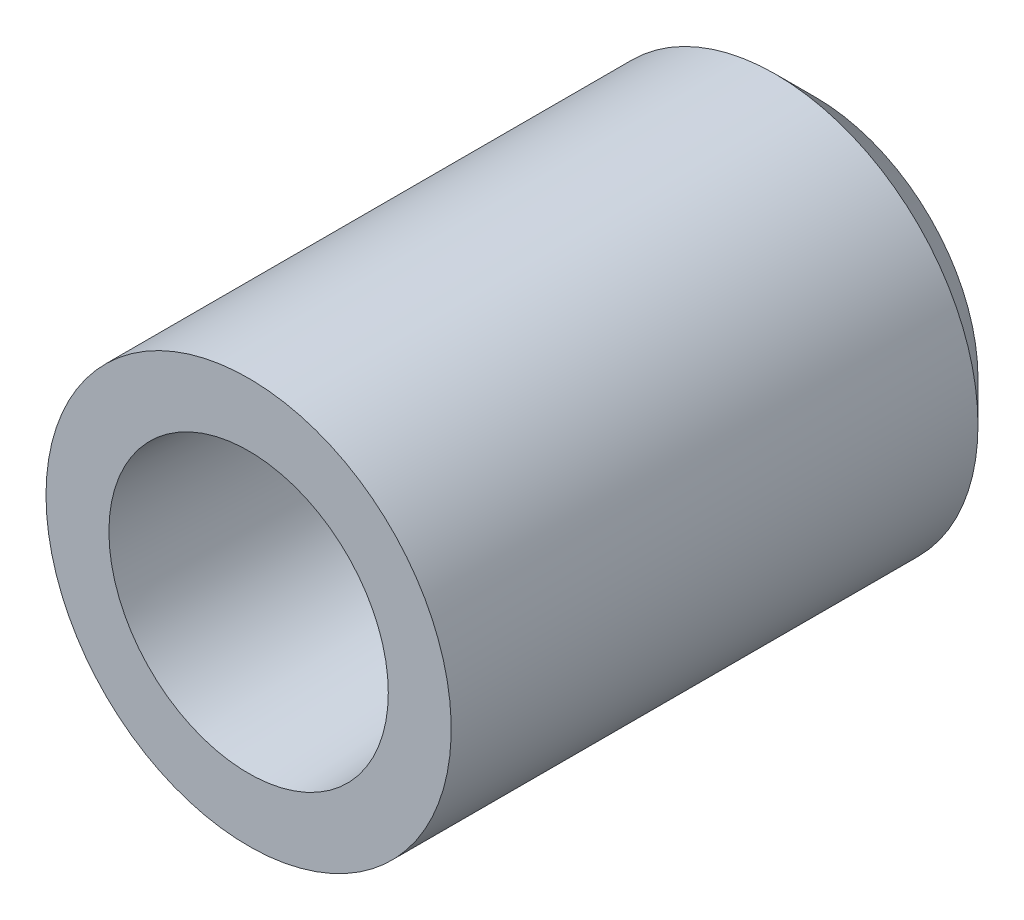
ISO-10303-21;
HEADER;
FILE_DESCRIPTION(('STEP AP214'),'2;1');
FILE_NAME('part.step','',(''),(''),'','','');
FILE_SCHEMA(('AUTOMOTIVE_DESIGN { 1 0 10303 214 1 1 1 1 }'));
ENDSEC;
DATA;
#1=APPLICATION_CONTEXT('core data for automotive mechanical design processes');
#2=APPLICATION_PROTOCOL_DEFINITION('international standard','automotive_design',2000,#1);
#3=PRODUCT_CONTEXT('',#1,'mechanical');
#4=PRODUCT('Part','Part','',(#3));
#5=PRODUCT_RELATED_PRODUCT_CATEGORY('part','',(#4));
#6=PRODUCT_DEFINITION_FORMATION('','',#4);
#7=PRODUCT_DEFINITION_CONTEXT('part definition',#1,'design');
#8=PRODUCT_DEFINITION('design','',#6,#7);
#9=PRODUCT_DEFINITION_SHAPE('','',#8);
#10=(LENGTH_UNIT() NAMED_UNIT(*) SI_UNIT(.MILLI.,.METRE.));
#11=(NAMED_UNIT(*) PLANE_ANGLE_UNIT() SI_UNIT($,.RADIAN.));
#12=(NAMED_UNIT(*) SI_UNIT($,.STERADIAN.) SOLID_ANGLE_UNIT());
#13=UNCERTAINTY_MEASURE_WITH_UNIT(LENGTH_MEASURE(1.E-05),#10,'distance_accuracy_value','');
#14=(GEOMETRIC_REPRESENTATION_CONTEXT(3) GLOBAL_UNCERTAINTY_ASSIGNED_CONTEXT((#13)) GLOBAL_UNIT_ASSIGNED_CONTEXT((#10,
#11,#12)) REPRESENTATION_CONTEXT('',''));
#15=CARTESIAN_POINT('',(0.,0.,0.));
#16=DIRECTION('',(0.,0.,1.));
#17=DIRECTION('',(1.,0.,0.));
#18=AXIS2_PLACEMENT_3D('',#15,#16,#17);
#19=CARTESIAN_POINT('',(0.,0.,-6.68050060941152));
#20=DIRECTION('',(0.,0.,1.));
#21=DIRECTION('',(1.,0.,0.));
#22=AXIS2_PLACEMENT_3D('',#19,#20,#21);
#23=CONICAL_SURFACE('',#22,4.50505271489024,0.785398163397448);
#24=CARTESIAN_POINT('',(0.,0.,-9.));
#25=DIRECTION('',(0.,0.,1.));
#26=DIRECTION('',(-1.,0.,0.));
#27=AXIS2_PLACEMENT_3D('',#24,#25,#26);
#28=CIRCLE('',#27,2.18555332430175);
#29=CARTESIAN_POINT('',(2.18555332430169,0.,-9.));
#30=VERTEX_POINT('',#29);
#31=CARTESIAN_POINT('',(-2.18555332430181,0.,-9.));
#32=VERTEX_POINT('',#31);
#33=EDGE_CURVE('E142',#30,#32,#28,.T.);
#34=ORIENTED_EDGE('',*,*,#33,.F.);
#35=CARTESIAN_POINT('',(2.18555194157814,0.,-9.00000138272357));
#36=CARTESIAN_POINT('',(3.18555409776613,0.,-7.99999922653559));
#37=B_SPLINE_CURVE_WITH_KNOTS('',1,(#35,#36),.UNSPECIFIED.,.F.,.F.,(2,2),(0.48513348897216,
0.707106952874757),.UNSPECIFIED.);
#38=CARTESIAN_POINT('',(3.18555332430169,0.,-8.));
#39=VERTEX_POINT('',#38);
#40=EDGE_CURVE('E44',#30,#39,#37,.T.);
#41=ORIENTED_EDGE('',*,*,#40,.T.);
#42=CARTESIAN_POINT('',(0.,0.,-8.));
#43=DIRECTION('',(0.,0.,-1.));
#44=DIRECTION('',(-1.,0.,0.));
#45=AXIS2_PLACEMENT_3D('',#42,#43,#44);
#46=CIRCLE('',#45,3.18555332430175);
#47=CARTESIAN_POINT('',(-3.18555332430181,0.,-8.));
#48=VERTEX_POINT('',#47);
#49=EDGE_CURVE('E11',#48,#39,#46,.T.);
#50=ORIENTED_EDGE('',*,*,#49,.F.);
#51=CARTESIAN_POINT('',(0.,0.,-8.));
#52=DIRECTION('',(0.,0.,-1.));
#53=DIRECTION('',(-1.,0.,0.));
#54=AXIS2_PLACEMENT_3D('',#51,#52,#53);
#55=CIRCLE('',#54,3.18555332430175);
#56=EDGE_CURVE('E51',#39,#48,#55,.T.);
#57=ORIENTED_EDGE('',*,*,#56,.F.);
#58=ORIENTED_EDGE('',*,*,#40,.F.);
#59=CARTESIAN_POINT('',(0.,0.,-9.));
#60=DIRECTION('',(0.,0.,1.));
#61=DIRECTION('',(-1.,0.,0.));
#62=AXIS2_PLACEMENT_3D('',#59,#60,#61);
#63=CIRCLE('',#62,2.18555332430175);
#64=EDGE_CURVE('E59',#32,#30,#63,.T.);
#65=ORIENTED_EDGE('',*,*,#64,.F.);
#66=EDGE_LOOP('',(#34,#41,#50,#57,#58,#65));
#67=FACE_BOUND('',#66,.T.);
#68=ADVANCED_FACE('F36',(#67),#23,.F.);
#69=CARTESIAN_POINT('',(0.,0.,-7.5));
#70=DIRECTION('',(0.,0.,-1.));
#71=DIRECTION('',(-1.,0.,0.));
#72=AXIS2_PLACEMENT_3D('',#69,#70,#71);
#73=CYLINDRICAL_SURFACE('',#72,3.18555332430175);
#74=CARTESIAN_POINT('',(0.,0.,-6.));
#75=DIRECTION('',(0.,0.,-1.));
#76=DIRECTION('',(-1.,0.,0.));
#77=AXIS2_PLACEMENT_3D('',#74,#75,#76);
#78=CIRCLE('',#77,3.18555332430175);
#79=CARTESIAN_POINT('',(-3.18555332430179,0.,-6.));
#80=VERTEX_POINT('',#79);
#81=EDGE_CURVE('E151',#80,#80,#78,.T.);
#82=ORIENTED_EDGE('',*,*,#81,.F.);
#83=CARTESIAN_POINT('',(-3.18555332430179,0.,-5.99999694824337));
#84=CARTESIAN_POINT('',(-3.18555332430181,0.,-8.000002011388));
#85=B_SPLINE_CURVE_WITH_KNOTS('',1,(#83,#84),.UNSPECIFIED.,.F.,.F.,(2,2),(0.0833320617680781,
0.91666750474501),.UNSPECIFIED.);
#86=EDGE_CURVE('E146',#80,#48,#85,.T.);
#87=ORIENTED_EDGE('',*,*,#86,.T.);
#88=ORIENTED_EDGE('',*,*,#49,.T.);
#89=ORIENTED_EDGE('',*,*,#56,.T.);
#90=ORIENTED_EDGE('',*,*,#86,.F.);
#91=EDGE_LOOP('',(#82,#87,#88,#89,#90));
#92=FACE_BOUND('',#91,.T.);
#93=ADVANCED_FACE('F192',(#92),#73,.F.);
#94=CARTESIAN_POINT('',(5.02677264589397,-4.54258728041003,-9.));
#95=DIRECTION('',(0.,0.,-1.));
#96=DIRECTION('',(-1.,0.,0.));
#97=AXIS2_PLACEMENT_3D('',#94,#95,#96);
#98=PLANE('',#97);
#99=CARTESIAN_POINT('',(-1.04744440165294E-13,0.,-8.99999999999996));
#100=DIRECTION('',(0.,0.,-1.));
#101=DIRECTION('',(-1.,0.,0.));
#102=AXIS2_PLACEMENT_3D('',#99,#100,#101);
#103=CIRCLE('',#102,1.64999999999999);
#104=CARTESIAN_POINT('',(-1.6500000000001,0.,-8.99999999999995));
#105=VERTEX_POINT('',#104);
#106=EDGE_CURVE('E39',#105,#105,#103,.T.);
#107=ORIENTED_EDGE('',*,*,#106,.T.);
#108=EDGE_LOOP('',(#107));
#109=FACE_BOUND('',#108,.T.);
#110=ORIENTED_EDGE('',*,*,#64,.T.);
#111=ORIENTED_EDGE('',*,*,#33,.T.);
#112=EDGE_LOOP('',(#110,#111));
#113=FACE_BOUND('',#112,.T.);
#114=ADVANCED_FACE('F194',(#109,#113),#98,.F.);
#115=CARTESIAN_POINT('',(0.,0.,-1.));
#116=DIRECTION('',(0.,0.,1.));
#117=DIRECTION('',(-1.,0.,0.));
#118=AXIS2_PLACEMENT_3D('',#115,#116,#117);
#119=CONICAL_SURFACE('',#118,3.44759222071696,0.0523598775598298);
#120=ORIENTED_EDGE('',*,*,#81,.T.);
#121=CARTESIAN_POINT('',(-3.18555332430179,0.,-6.));
#122=CARTESIAN_POINT('',(-3.44759222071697,0.,-0.999999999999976));
#123=B_SPLINE_CURVE_WITH_KNOTS('',1,(#121,#122),.UNSPECIFIED.,.F.,.F.,(2,2),(0.,1.),.UNSPECIFIED.);
#124=CARTESIAN_POINT('',(-3.44759222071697,0.,-0.999999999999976));
#125=VERTEX_POINT('',#124);
#126=EDGE_CURVE('E107',#80,#125,#123,.T.);
#127=ORIENTED_EDGE('',*,*,#126,.T.);
#128=CARTESIAN_POINT('',(0.,0.,-1.));
#129=DIRECTION('',(0.,0.,-1.));
#130=DIRECTION('',(1.,0.,0.));
#131=AXIS2_PLACEMENT_3D('',#128,#129,#130);
#132=CIRCLE('',#131,3.44759222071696);
#133=CARTESIAN_POINT('',(3.44759222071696,0.,-1.00000000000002));
#134=VERTEX_POINT('',#133);
#135=EDGE_CURVE('E132',#134,#125,#132,.T.);
#136=ORIENTED_EDGE('',*,*,#135,.F.);
#137=CARTESIAN_POINT('',(0.,0.,-1.));
#138=DIRECTION('',(0.,0.,-1.));
#139=DIRECTION('',(1.,0.,0.));
#140=AXIS2_PLACEMENT_3D('',#137,#138,#139);
#141=CIRCLE('',#140,3.44759222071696);
#142=EDGE_CURVE('E125',#125,#134,#141,.T.);
#143=ORIENTED_EDGE('',*,*,#142,.F.);
#144=ORIENTED_EDGE('',*,*,#126,.F.);
#145=EDGE_LOOP('',(#120,#127,#136,#143,#144));
#146=FACE_BOUND('',#145,.T.);
#147=ADVANCED_FACE('F190',(#146),#119,.F.);
#148=CARTESIAN_POINT('',(0.,0.,-11.9289321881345));
#149=DIRECTION('',(0.,0.,1.));
#150=DIRECTION('',(1.,0.,0.));
#151=AXIS2_PLACEMENT_3D('',#148,#149,#150);
#152=CONICAL_SURFACE('',#151,7.07106781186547,0.785398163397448);
#153=CARTESIAN_POINT('',(-1.04744440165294E-13,0.,-15.));
#154=DIRECTION('',(0.,0.,1.));
#155=DIRECTION('',(-1.,0.,0.));
#156=AXIS2_PLACEMENT_3D('',#153,#154,#155);
#157=CIRCLE('',#156,4.);
#158=CARTESIAN_POINT('',(-4.0000000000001,0.,-15.));
#159=VERTEX_POINT('',#158);
#160=CARTESIAN_POINT('',(3.9999999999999,0.,-15.));
#161=VERTEX_POINT('',#160);
#162=EDGE_CURVE('E90',#159,#161,#157,.T.);
#163=ORIENTED_EDGE('',*,*,#162,.T.);
#164=CARTESIAN_POINT('',(4.00000161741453,0.,-14.9999983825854));
#165=CARTESIAN_POINT('',(5.00000126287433,0.,-13.9999987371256));
#166=B_SPLINE_CURVE_WITH_KNOTS('',1,(#164,#165),.UNSPECIFIED.,.F.,.F.,(2,2),(0.56568565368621,
0.707106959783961),.UNSPECIFIED.);
#167=CARTESIAN_POINT('',(4.9999999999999,0.,-14.));
#168=VERTEX_POINT('',#167);
#169=EDGE_CURVE('E95',#161,#168,#166,.T.);
#170=ORIENTED_EDGE('',*,*,#169,.T.);
#171=CARTESIAN_POINT('',(0.,0.,-14.));
#172=DIRECTION('',(0.,0.,-1.));
#173=DIRECTION('',(-1.,0.,0.));
#174=AXIS2_PLACEMENT_3D('',#171,#172,#173);
#175=CIRCLE('',#174,5.);
#176=CARTESIAN_POINT('',(-5.0000000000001,0.,-14.));
#177=VERTEX_POINT('',#176);
#178=EDGE_CURVE('E102',#168,#177,#175,.T.);
#179=ORIENTED_EDGE('',*,*,#178,.T.);
#180=CARTESIAN_POINT('',(0.,0.,-14.));
#181=DIRECTION('',(0.,0.,-1.));
#182=DIRECTION('',(-1.,0.,0.));
#183=AXIS2_PLACEMENT_3D('',#180,#181,#182);
#184=CIRCLE('',#183,5.);
#185=EDGE_CURVE('E104',#177,#168,#184,.T.);
#186=ORIENTED_EDGE('',*,*,#185,.T.);
#187=ORIENTED_EDGE('',*,*,#169,.F.);
#188=CARTESIAN_POINT('',(-1.04744440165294E-13,0.,-15.));
#189=DIRECTION('',(0.,0.,1.));
#190=DIRECTION('',(-1.,0.,0.));
#191=AXIS2_PLACEMENT_3D('',#188,#189,#190);
#192=CIRCLE('',#191,4.);
#193=EDGE_CURVE('E97',#161,#159,#192,.T.);
#194=ORIENTED_EDGE('',*,*,#193,.T.);
#195=EDGE_LOOP('',(#163,#170,#179,#186,#187,#194));
#196=FACE_BOUND('',#195,.T.);
#197=ADVANCED_FACE('F92',(#196),#152,.T.);
#198=CARTESIAN_POINT('',(0.,0.,-8.));
#199=DIRECTION('',(0.,0.,-1.));
#200=DIRECTION('',(-1.,0.,0.));
#201=AXIS2_PLACEMENT_3D('',#198,#199,#200);
#202=CYLINDRICAL_SURFACE('',#201,5.);
#203=CARTESIAN_POINT('',(0.,0.,-1.));
#204=DIRECTION('',(0.,0.,1.));
#205=DIRECTION('',(-1.,0.,0.));
#206=AXIS2_PLACEMENT_3D('',#203,#204,#205);
#207=CIRCLE('',#206,5.);
#208=CARTESIAN_POINT('',(-5.,0.,-0.999999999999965));
#209=VERTEX_POINT('',#208);
#210=EDGE_CURVE('E99',#209,#209,#207,.T.);
#211=ORIENTED_EDGE('',*,*,#210,.F.);
#212=CARTESIAN_POINT('',(-5.,0.,-1.00000099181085));
#213=CARTESIAN_POINT('',(-5.0000000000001,0.,-14.0000013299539));
#214=B_SPLINE_CURVE_WITH_KNOTS('',1,(#212,#213),.UNSPECIFIED.,.F.,.F.,(2,2),(0.0833333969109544,
0.916666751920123),.UNSPECIFIED.);
#215=EDGE_CURVE('E172',#209,#177,#214,.T.);
#216=ORIENTED_EDGE('',*,*,#215,.T.);
#217=ORIENTED_EDGE('',*,*,#178,.F.);
#218=ORIENTED_EDGE('',*,*,#185,.F.);
#219=ORIENTED_EDGE('',*,*,#215,.F.);
#220=EDGE_LOOP('',(#211,#216,#217,#218,#219));
#221=FACE_BOUND('',#220,.T.);
#222=ADVANCED_FACE('F226',(#221),#202,.T.);
#223=CARTESIAN_POINT('',(9.1999999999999,-8.31384387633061,-15.));
#224=DIRECTION('',(0.,0.,-1.));
#225=DIRECTION('',(-1.,0.,0.));
#226=AXIS2_PLACEMENT_3D('',#223,#224,#225);
#227=PLANE('',#226);
#228=CARTESIAN_POINT('',(-1.04744440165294E-13,0.,-14.9999999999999));
#229=DIRECTION('',(0.,0.,-1.));
#230=DIRECTION('',(-1.,0.,0.));
#231=AXIS2_PLACEMENT_3D('',#228,#229,#230);
#232=CIRCLE('',#231,1.64999999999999);
#233=CARTESIAN_POINT('',(-1.65000000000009,0.,-14.9999999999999));
#234=VERTEX_POINT('',#233);
#235=EDGE_CURVE('E276',#234,#234,#232,.T.);
#236=ORIENTED_EDGE('',*,*,#235,.F.);
#237=EDGE_LOOP('',(#236));
#238=FACE_BOUND('',#237,.T.);
#239=ORIENTED_EDGE('',*,*,#193,.F.);
#240=ORIENTED_EDGE('',*,*,#162,.F.);
#241=EDGE_LOOP('',(#239,#240));
#242=FACE_BOUND('',#241,.T.);
#243=ADVANCED_FACE('F101',(#238,#242),#227,.T.);
#244=CARTESIAN_POINT('',(-6.5,-10.3923048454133,-0.999999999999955));
#245=DIRECTION('',(0.,0.,1.));
#246=DIRECTION('',(1.,0.,0.));
#247=AXIS2_PLACEMENT_3D('',#244,#245,#246);
#248=PLANE('',#247);
#249=ORIENTED_EDGE('',*,*,#210,.T.);
#250=EDGE_LOOP('',(#249));
#251=FACE_BOUND('',#250,.T.);
#252=ORIENTED_EDGE('',*,*,#135,.T.);
#253=ORIENTED_EDGE('',*,*,#142,.T.);
#254=EDGE_LOOP('',(#252,#253));
#255=FACE_BOUND('',#254,.T.);
#256=ADVANCED_FACE('F241',(#251,#255),#248,.T.);
#257=CARTESIAN_POINT('',(-1.04744440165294E-13,0.,-14.9999999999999));
#258=DIRECTION('',(0.,0.,-1.));
#259=DIRECTION('',(-1.,0.,0.));
#260=AXIS2_PLACEMENT_3D('',#257,#258,#259);
#261=CYLINDRICAL_SURFACE('',#260,1.64999999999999);
#262=ORIENTED_EDGE('',*,*,#235,.T.);
#263=EDGE_LOOP('',(#262));
#264=FACE_BOUND('',#263,.T.);
#265=ORIENTED_EDGE('',*,*,#106,.F.);
#266=EDGE_LOOP('',(#265));
#267=FACE_BOUND('',#266,.T.);
#268=ADVANCED_FACE('F249',(#264,#267),#261,.F.);
#269=CLOSED_SHELL('',(#68,#93,#114,#147,#197,#222,#243,#256,#268));
#270=MANIFOLD_SOLID_BREP('B2',#269);
#271=ADVANCED_BREP_SHAPE_REPRESENTATION('',(#18,#270),#14);
#272=SHAPE_DEFINITION_REPRESENTATION(#9,#271);
ENDSEC;
END-ISO-10303-21;
